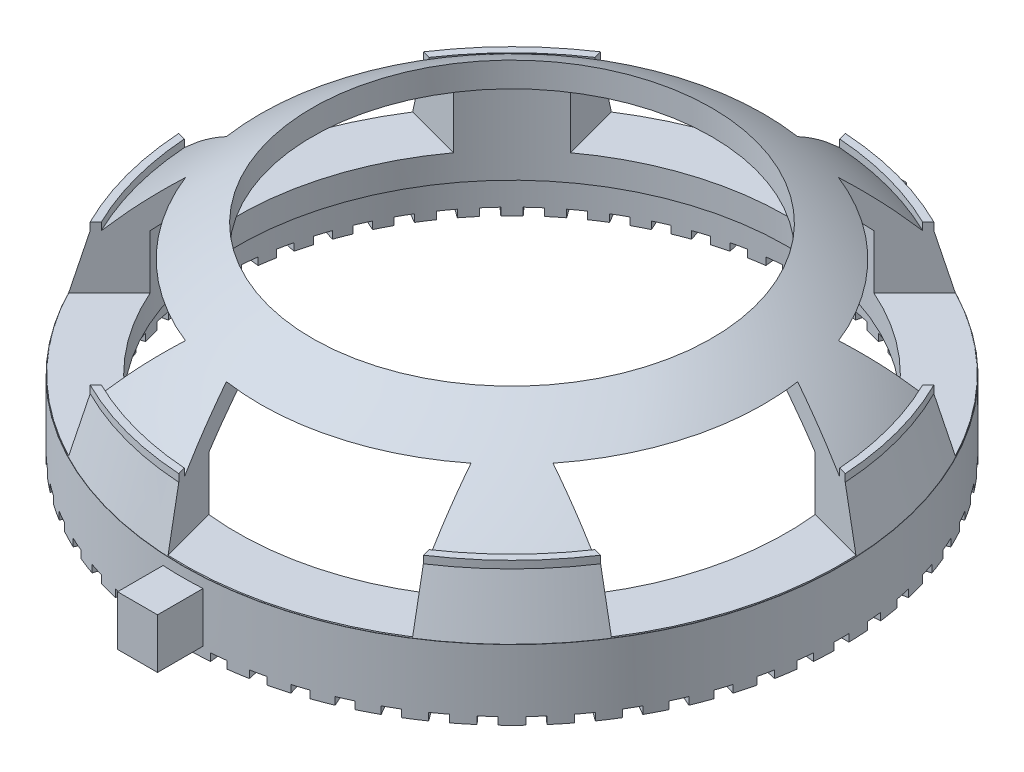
from build123d import *

# Parameters (mm, degrees)
BOSS_EXTRUDE1_REACH      = 18.085
BOSS_EXTRUDE1_END_RADIUS = 6.6
SKETCH2_W                = 0.8
SKETCH2_H                = 1
SKETCH3_W                = 0.8
SKETCH3_H                = 1
BOSS_EXTRUDE2_DEPTH      = 1
SKETCH7_W                = 2
SKETCH7_H                = 4
CUT_EXTRUDE2_DEPTH       = 10
CIRPATTERN4_COUNT        = 6
SKETCH8_W                = 0.3
SKETCH8_H                = 0.3
CUT_EXTRUDE3_DEPTH       = 10
CIRPATTERN5_COUNT        = 60


with BuildPart() as part:
    # Sketch1 → Revolve2 (revolve)
    with BuildSketch(Plane.XY, mode=Mode.PRIVATE) as revolve2_sk:
        with BuildLine():
            Line((5.9, 0), (6.6, 0))
            Line((6.6, 0), (6.6, 1.4))
            Line((6.6, 1.4), (6.594744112, 1.4))
            Line((6.594744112, 1.4), (6.3, 2.5))
            Line((6.3, 2.5), (6.3, 2.65))
            Line((6.3, 2.65), (6.15, 2.65))
            Line((6.15, 2.65), (6.15, 2.5))
            ThreePointArc((6.15, 2.5), (5.133391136, 3.353364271), (4, 4.044123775))
            Line((4, 4.044123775), (4, 3.545204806))
            ThreePointArc((4, 3.545204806), (4.778662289, 3.063736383), (5.5, 2.5))
            Line((5.5, 2.5), (5.5, 0.9))
            Line((5.5, 0.9), (5.9, 0.9))
            Line((5.9, 0.9), (5.9, 0))
        make_face()
    revolve(revolve2_sk.sketch.rotate(Axis((0, 0, 0), (0, 1, 0)), 90), axis=Axis((0, 0, 0), (0, 1, 0)))

    # Boss-Extrude1: up to this cylinder (the profile starts outside it)
    boss_extrude1_end = Plane(origin=(0, 0.7, 0), z_dir=(0, -1, 0)) * Cylinder(BOSS_EXTRUDE1_END_RADIUS, 50.37, mode=Mode.PRIVATE)
    # Sketch2 → Boss-Extrude1 (add, up to the surface)
    with BuildSketch(Plane.XY.offset(-7.5), mode=Mode.PRIVATE) as boss_extrude1_sk1:
        with Locations((0, 0.7)):
            Rectangle(SKETCH2_W, SKETCH2_H)
    boss_extrude1_tool1 = extrude(boss_extrude1_sk1.sketch, amount=BOSS_EXTRUDE1_REACH, mode=Mode.PRIVATE) - boss_extrude1_end
    add(boss_extrude1_tool1.solids().sort_by_distance((0, 0.7, -7.5))[0])

    # Sketch3 → Boss-Extrude2 (add)
    with BuildSketch(Plane.XY.offset(7.5)):
        with Locations((0, 0.7)):
            Rectangle(SKETCH3_W, SKETCH3_H)
    extrude(amount=-BOSS_EXTRUDE2_DEPTH)

    # Sketch7 → Cut-Extrude2 (cut)
    with BuildSketch(Plane(origin=(0, 0, 0), x_dir=(0, 1, 0), z_dir=(0.7071067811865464, 0, -0.7071067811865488))):
        with Locations((2.42, 0)):
            Rectangle(SKETCH7_W, SKETCH7_H)
    cut_extrude2 = extrude(amount=-CUT_EXTRUDE2_DEPTH, mode=Mode.SUBTRACT)

    # CirPattern4: Cut-Extrude2 ×6 about axis
    cirpattern4_axis = Axis((0, 0, 0), (0, 1, 0))
    for i in range(1, CIRPATTERN4_COUNT):
        add(cut_extrude2.rotate(cirpattern4_axis, i * 360 / CIRPATTERN4_COUNT), mode=Mode.SUBTRACT)

    # Sketch8 → Cut-Extrude3 (cut)
    with BuildSketch(Plane.XY):
        Rectangle(SKETCH8_W, SKETCH8_H)
    cut_extrude3 = extrude(amount=-CUT_EXTRUDE3_DEPTH, mode=Mode.SUBTRACT)

    # CirPattern5: Cut-Extrude3 ×60 about axis
    cirpattern5_axis = Axis((0, 0, 0), (0, 1, 0))
    for i in range(1, CIRPATTERN5_COUNT):
        add(cut_extrude3.rotate(cirpattern5_axis, i * 360 / CIRPATTERN5_COUNT), mode=Mode.SUBTRACT)


solid = part.part
